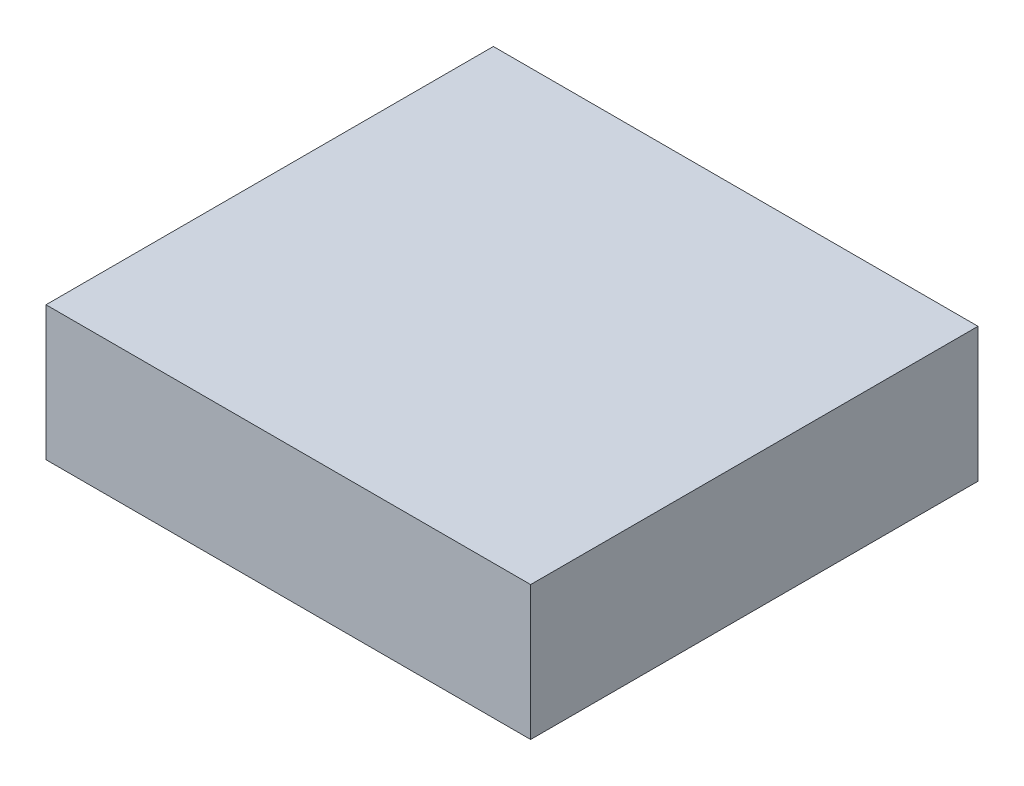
from build123d import *

# Parameters (mm, degrees)
SKETCH1_W           = 65
SKETCH1_H           = 60
BOSS_EXTRUDE1_DEPTH = 18


with BuildPart() as part:
    # Sketch1 → Boss-Extrude1 (new body)
    with BuildSketch(Plane(origin=(0, 0, 0), x_dir=(1, 0, 0), z_dir=(0, 1, 0))):
        Rectangle(SKETCH1_W, SKETCH1_H)
    extrude(amount=BOSS_EXTRUDE1_DEPTH)


solid = part.part
